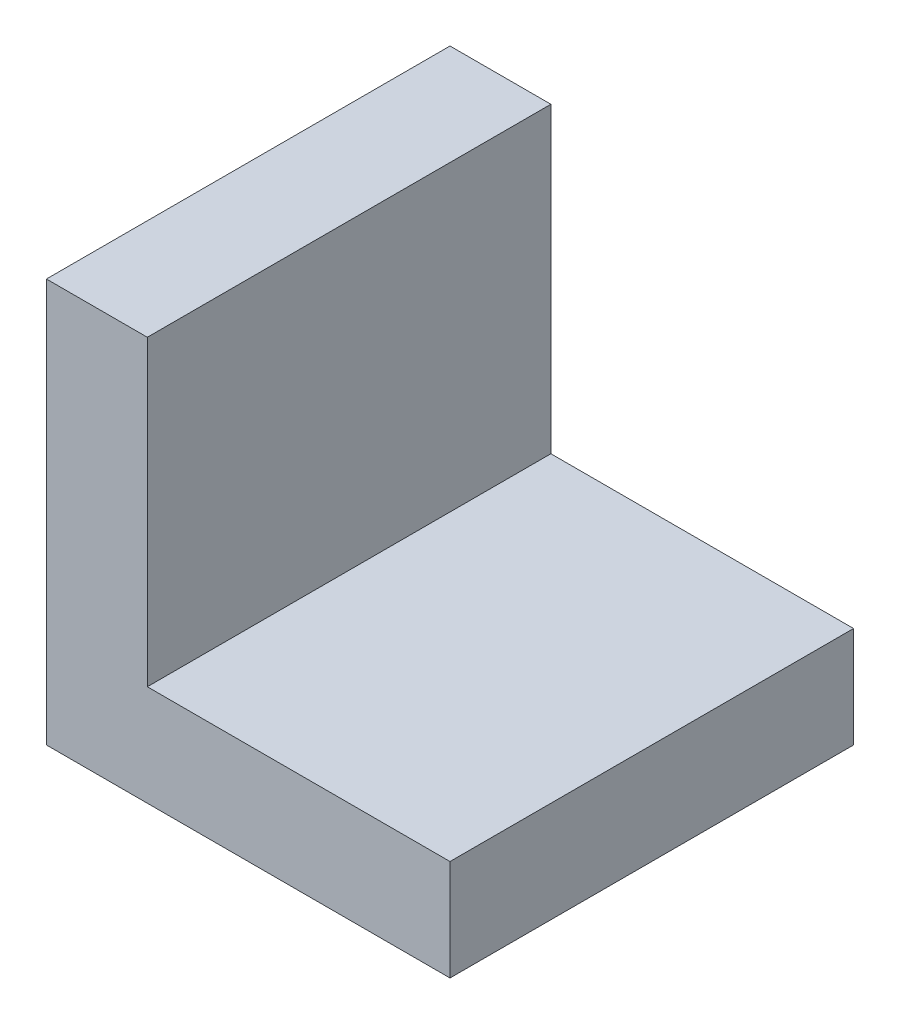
ISO-10303-21;
HEADER;
FILE_DESCRIPTION(('STEP AP214'),'2;1');
FILE_NAME('part.step','',(''),(''),'','','');
FILE_SCHEMA(('AUTOMOTIVE_DESIGN { 1 0 10303 214 1 1 1 1 }'));
ENDSEC;
DATA;
#1=APPLICATION_CONTEXT('core data for automotive mechanical design processes');
#2=APPLICATION_PROTOCOL_DEFINITION('international standard','automotive_design',2000,#1);
#3=PRODUCT_CONTEXT('',#1,'mechanical');
#4=PRODUCT('Part','Part','',(#3));
#5=PRODUCT_RELATED_PRODUCT_CATEGORY('part','',(#4));
#6=PRODUCT_DEFINITION_FORMATION('','',#4);
#7=PRODUCT_DEFINITION_CONTEXT('part definition',#1,'design');
#8=PRODUCT_DEFINITION('design','',#6,#7);
#9=PRODUCT_DEFINITION_SHAPE('','',#8);
#10=(LENGTH_UNIT() NAMED_UNIT(*) SI_UNIT(.MILLI.,.METRE.));
#11=(NAMED_UNIT(*) PLANE_ANGLE_UNIT() SI_UNIT($,.RADIAN.));
#12=(NAMED_UNIT(*) SI_UNIT($,.STERADIAN.) SOLID_ANGLE_UNIT());
#13=UNCERTAINTY_MEASURE_WITH_UNIT(LENGTH_MEASURE(1.E-05),#10,'distance_accuracy_value','');
#14=(GEOMETRIC_REPRESENTATION_CONTEXT(3) GLOBAL_UNCERTAINTY_ASSIGNED_CONTEXT((#13)) GLOBAL_UNIT_ASSIGNED_CONTEXT((#10,
#11,#12)) REPRESENTATION_CONTEXT('',''));
#15=CARTESIAN_POINT('',(0.,0.,0.));
#16=DIRECTION('',(0.,0.,1.));
#17=DIRECTION('',(1.,0.,0.));
#18=AXIS2_PLACEMENT_3D('',#15,#16,#17);
#19=CARTESIAN_POINT('',(25.,100.,100.));
#20=DIRECTION('',(0.,-1.,0.));
#21=DIRECTION('',(0.,0.,-1.));
#22=AXIS2_PLACEMENT_3D('',#19,#20,#21);
#23=PLANE('',#22);
#24=DIRECTION('',(-1.,0.,0.));
#25=VECTOR('',#24,1.);
#26=CARTESIAN_POINT('',(25.,100.,0.));
#27=LINE('',#26,#25);
#28=CARTESIAN_POINT('',(25.,100.,0.));
#29=VERTEX_POINT('',#28);
#30=CARTESIAN_POINT('',(0.,100.,0.));
#31=VERTEX_POINT('',#30);
#32=EDGE_CURVE('E116',#29,#31,#27,.T.);
#33=ORIENTED_EDGE('',*,*,#32,.T.);
#34=DIRECTION('',(0.,0.,-1.));
#35=VECTOR('',#34,1.);
#36=CARTESIAN_POINT('',(0.,100.,100.));
#37=LINE('',#36,#35);
#38=CARTESIAN_POINT('',(0.,100.,100.));
#39=VERTEX_POINT('',#38);
#40=EDGE_CURVE('E11',#39,#31,#37,.T.);
#41=ORIENTED_EDGE('',*,*,#40,.F.);
#42=DIRECTION('',(-1.,0.,0.));
#43=VECTOR('',#42,1.);
#44=CARTESIAN_POINT('',(25.,100.,100.));
#45=LINE('',#44,#43);
#46=CARTESIAN_POINT('',(25.,100.,100.));
#47=VERTEX_POINT('',#46);
#48=EDGE_CURVE('E126',#47,#39,#45,.T.);
#49=ORIENTED_EDGE('',*,*,#48,.F.);
#50=DIRECTION('',(0.,0.,-1.));
#51=VECTOR('',#50,1.);
#52=CARTESIAN_POINT('',(25.,100.,100.));
#53=LINE('',#52,#51);
#54=EDGE_CURVE('E112',#47,#29,#53,.T.);
#55=ORIENTED_EDGE('',*,*,#54,.T.);
#56=EDGE_LOOP('',(#33,#41,#49,#55));
#57=FACE_BOUND('',#56,.T.);
#58=ADVANCED_FACE('F32',(#57),#23,.F.);
#59=CARTESIAN_POINT('',(0.,100.,100.));
#60=DIRECTION('',(1.,0.,0.));
#61=DIRECTION('',(0.,0.,-1.));
#62=AXIS2_PLACEMENT_3D('',#59,#60,#61);
#63=PLANE('',#62);
#64=DIRECTION('',(0.,-1.,0.));
#65=VECTOR('',#64,1.);
#66=CARTESIAN_POINT('',(0.,100.,0.));
#67=LINE('',#66,#65);
#68=CARTESIAN_POINT('',(0.,0.,0.));
#69=VERTEX_POINT('',#68);
#70=EDGE_CURVE('E119',#31,#69,#67,.T.);
#71=ORIENTED_EDGE('',*,*,#70,.T.);
#72=DIRECTION('',(0.,0.,-1.));
#73=VECTOR('',#72,1.);
#74=CARTESIAN_POINT('',(0.,0.,100.));
#75=LINE('',#74,#73);
#76=CARTESIAN_POINT('',(0.,0.,100.));
#77=VERTEX_POINT('',#76);
#78=EDGE_CURVE('E40',#77,#69,#75,.T.);
#79=ORIENTED_EDGE('',*,*,#78,.F.);
#80=DIRECTION('',(0.,-1.,0.));
#81=VECTOR('',#80,1.);
#82=CARTESIAN_POINT('',(0.,100.,100.));
#83=LINE('',#82,#81);
#84=EDGE_CURVE('E85',#39,#77,#83,.T.);
#85=ORIENTED_EDGE('',*,*,#84,.F.);
#86=ORIENTED_EDGE('',*,*,#40,.T.);
#87=EDGE_LOOP('',(#71,#79,#85,#86));
#88=FACE_BOUND('',#87,.T.);
#89=ADVANCED_FACE('F150',(#88),#63,.F.);
#90=CARTESIAN_POINT('',(0.,0.,100.));
#91=DIRECTION('',(0.,1.,0.));
#92=DIRECTION('',(0.,0.,1.));
#93=AXIS2_PLACEMENT_3D('',#90,#91,#92);
#94=PLANE('',#93);
#95=DIRECTION('',(1.,0.,0.));
#96=VECTOR('',#95,1.);
#97=CARTESIAN_POINT('',(0.,0.,0.));
#98=LINE('',#97,#96);
#99=CARTESIAN_POINT('',(100.,0.,0.));
#100=VERTEX_POINT('',#99);
#101=EDGE_CURVE('E121',#69,#100,#98,.T.);
#102=ORIENTED_EDGE('',*,*,#101,.T.);
#103=DIRECTION('',(0.,0.,-1.));
#104=VECTOR('',#103,1.);
#105=CARTESIAN_POINT('',(100.,0.,100.));
#106=LINE('',#105,#104);
#107=CARTESIAN_POINT('',(100.,0.,100.));
#108=VERTEX_POINT('',#107);
#109=EDGE_CURVE('E107',#108,#100,#106,.T.);
#110=ORIENTED_EDGE('',*,*,#109,.F.);
#111=DIRECTION('',(1.,0.,0.));
#112=VECTOR('',#111,1.);
#113=CARTESIAN_POINT('',(0.,0.,100.));
#114=LINE('',#113,#112);
#115=EDGE_CURVE('E98',#77,#108,#114,.T.);
#116=ORIENTED_EDGE('',*,*,#115,.F.);
#117=ORIENTED_EDGE('',*,*,#78,.T.);
#118=EDGE_LOOP('',(#102,#110,#116,#117));
#119=FACE_BOUND('',#118,.T.);
#120=ADVANCED_FACE('F132',(#119),#94,.F.);
#121=CARTESIAN_POINT('',(100.,0.,100.));
#122=DIRECTION('',(-1.,0.,0.));
#123=DIRECTION('',(0.,0.,1.));
#124=AXIS2_PLACEMENT_3D('',#121,#122,#123);
#125=PLANE('',#124);
#126=DIRECTION('',(0.,1.,0.));
#127=VECTOR('',#126,1.);
#128=CARTESIAN_POINT('',(100.,0.,0.));
#129=LINE('',#128,#127);
#130=CARTESIAN_POINT('',(100.,25.,0.));
#131=VERTEX_POINT('',#130);
#132=EDGE_CURVE('E106',#100,#131,#129,.T.);
#133=ORIENTED_EDGE('',*,*,#132,.T.);
#134=DIRECTION('',(0.,0.,-1.));
#135=VECTOR('',#134,1.);
#136=CARTESIAN_POINT('',(100.,25.,100.));
#137=LINE('',#136,#135);
#138=CARTESIAN_POINT('',(100.,25.,100.));
#139=VERTEX_POINT('',#138);
#140=EDGE_CURVE('E103',#139,#131,#137,.T.);
#141=ORIENTED_EDGE('',*,*,#140,.F.);
#142=DIRECTION('',(0.,1.,0.));
#143=VECTOR('',#142,1.);
#144=CARTESIAN_POINT('',(100.,0.,100.));
#145=LINE('',#144,#143);
#146=EDGE_CURVE('E92',#108,#139,#145,.T.);
#147=ORIENTED_EDGE('',*,*,#146,.F.);
#148=ORIENTED_EDGE('',*,*,#109,.T.);
#149=EDGE_LOOP('',(#133,#141,#147,#148));
#150=FACE_BOUND('',#149,.T.);
#151=ADVANCED_FACE('F104',(#150),#125,.F.);
#152=CARTESIAN_POINT('',(100.,25.,100.));
#153=DIRECTION('',(0.,-1.,0.));
#154=DIRECTION('',(1.,0.,0.));
#155=AXIS2_PLACEMENT_3D('',#152,#153,#154);
#156=PLANE('',#155);
#157=DIRECTION('',(-1.,0.,0.));
#158=VECTOR('',#157,1.);
#159=CARTESIAN_POINT('',(100.,25.,0.));
#160=LINE('',#159,#158);
#161=CARTESIAN_POINT('',(25.,25.,0.));
#162=VERTEX_POINT('',#161);
#163=EDGE_CURVE('E71',#131,#162,#160,.T.);
#164=ORIENTED_EDGE('',*,*,#163,.T.);
#165=DIRECTION('',(0.,0.,-1.));
#166=VECTOR('',#165,1.);
#167=CARTESIAN_POINT('',(25.,25.,100.));
#168=LINE('',#167,#166);
#169=CARTESIAN_POINT('',(25.,25.,100.));
#170=VERTEX_POINT('',#169);
#171=EDGE_CURVE('E108',#170,#162,#168,.T.);
#172=ORIENTED_EDGE('',*,*,#171,.F.);
#173=DIRECTION('',(-1.,0.,0.));
#174=VECTOR('',#173,1.);
#175=CARTESIAN_POINT('',(100.,25.,100.));
#176=LINE('',#175,#174);
#177=EDGE_CURVE('E96',#139,#170,#176,.T.);
#178=ORIENTED_EDGE('',*,*,#177,.F.);
#179=ORIENTED_EDGE('',*,*,#140,.T.);
#180=EDGE_LOOP('',(#164,#172,#178,#179));
#181=FACE_BOUND('',#180,.T.);
#182=ADVANCED_FACE('F110',(#181),#156,.F.);
#183=CARTESIAN_POINT('',(25.,25.,100.));
#184=DIRECTION('',(-1.,0.,0.));
#185=DIRECTION('',(0.,0.,1.));
#186=AXIS2_PLACEMENT_3D('',#183,#184,#185);
#187=PLANE('',#186);
#188=DIRECTION('',(0.,1.,0.));
#189=VECTOR('',#188,1.);
#190=CARTESIAN_POINT('',(25.,25.,0.));
#191=LINE('',#190,#189);
#192=EDGE_CURVE('E77',#162,#29,#191,.T.);
#193=ORIENTED_EDGE('',*,*,#192,.T.);
#194=ORIENTED_EDGE('',*,*,#54,.F.);
#195=DIRECTION('',(0.,1.,0.));
#196=VECTOR('',#195,1.);
#197=CARTESIAN_POINT('',(25.,25.,100.));
#198=LINE('',#197,#196);
#199=EDGE_CURVE('E48',#170,#47,#198,.T.);
#200=ORIENTED_EDGE('',*,*,#199,.F.);
#201=ORIENTED_EDGE('',*,*,#171,.T.);
#202=EDGE_LOOP('',(#193,#194,#200,#201));
#203=FACE_BOUND('',#202,.T.);
#204=ADVANCED_FACE('F139',(#203),#187,.F.);
#205=CARTESIAN_POINT('',(0.,0.,100.));
#206=DIRECTION('',(0.,0.,1.));
#207=DIRECTION('',(1.,0.,0.));
#208=AXIS2_PLACEMENT_3D('',#205,#206,#207);
#209=PLANE('',#208);
#210=ORIENTED_EDGE('',*,*,#48,.T.);
#211=ORIENTED_EDGE('',*,*,#84,.T.);
#212=ORIENTED_EDGE('',*,*,#115,.T.);
#213=ORIENTED_EDGE('',*,*,#146,.T.);
#214=ORIENTED_EDGE('',*,*,#177,.T.);
#215=ORIENTED_EDGE('',*,*,#199,.T.);
#216=EDGE_LOOP('',(#210,#211,#212,#213,#214,#215));
#217=FACE_BOUND('',#216,.T.);
#218=ADVANCED_FACE('F94',(#217),#209,.T.);
#219=CARTESIAN_POINT('',(0.,0.,0.));
#220=DIRECTION('',(0.,0.,1.));
#221=DIRECTION('',(1.,0.,0.));
#222=AXIS2_PLACEMENT_3D('',#219,#220,#221);
#223=PLANE('',#222);
#224=ORIENTED_EDGE('',*,*,#32,.F.);
#225=ORIENTED_EDGE('',*,*,#192,.F.);
#226=ORIENTED_EDGE('',*,*,#163,.F.);
#227=ORIENTED_EDGE('',*,*,#132,.F.);
#228=ORIENTED_EDGE('',*,*,#101,.F.);
#229=ORIENTED_EDGE('',*,*,#70,.F.);
#230=EDGE_LOOP('',(#224,#225,#226,#227,#228,#229));
#231=FACE_BOUND('',#230,.T.);
#232=ADVANCED_FACE('F135',(#231),#223,.F.);
#233=CLOSED_SHELL('',(#58,#89,#120,#151,#182,#204,#218,#232));
#234=MANIFOLD_SOLID_BREP('B2',#233);
#235=ADVANCED_BREP_SHAPE_REPRESENTATION('',(#18,#234),#14);
#236=SHAPE_DEFINITION_REPRESENTATION(#9,#235);
ENDSEC;
END-ISO-10303-21;
